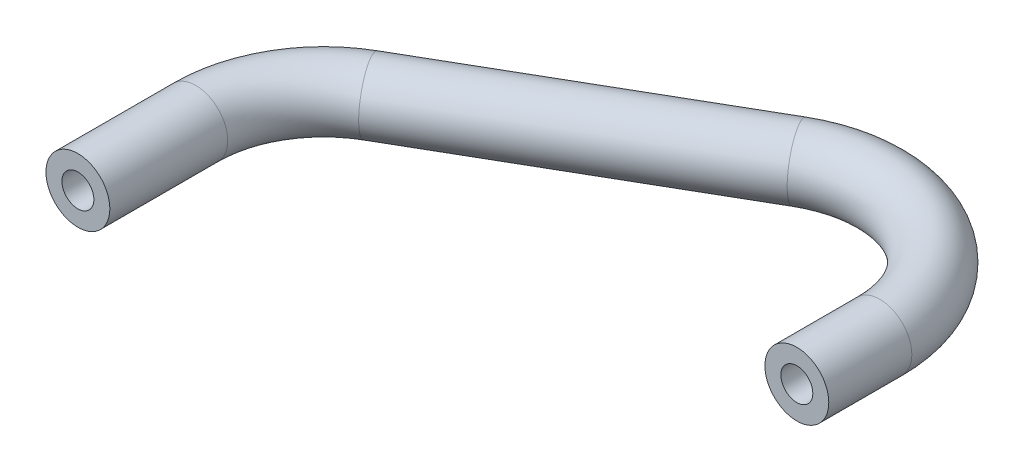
from build123d import *

# Parameters (mm, degrees)
SKETCH1_R   = 3.175
SKETCH1_R_2 = 1.5875


with BuildPart() as part:
    # Sweep1: sweep along a path in Sketch2
    with BuildLine(Plane(origin=(0, 0, 0), x_dir=(1, 0, 0), z_dir=(0, 1, 0))) as sweep1_path:
        Line((0, 0), (0, 11.717651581))
        ThreePointArc((0, 11.717651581), (1.701477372, 18.067651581), (6.35, 22.716174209))
        Line((6.35, 22.716174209), (33.34455612, 38.301488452))
        ThreePointArc((33.34455612, 38.301488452), (46.04455612, 38.301488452), (52.39455612, 27.302965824))
        Line((52.39455612, 27.302965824), (52.39455612, 19.05))
    # Sketch1 → Sweep1 (sweep)
    with BuildSketch(Plane.XY):
        Circle(SKETCH1_R)
        Circle(SKETCH1_R_2, mode=Mode.SUBTRACT)
    sweep(path=sweep1_path.line)


solid = part.part
